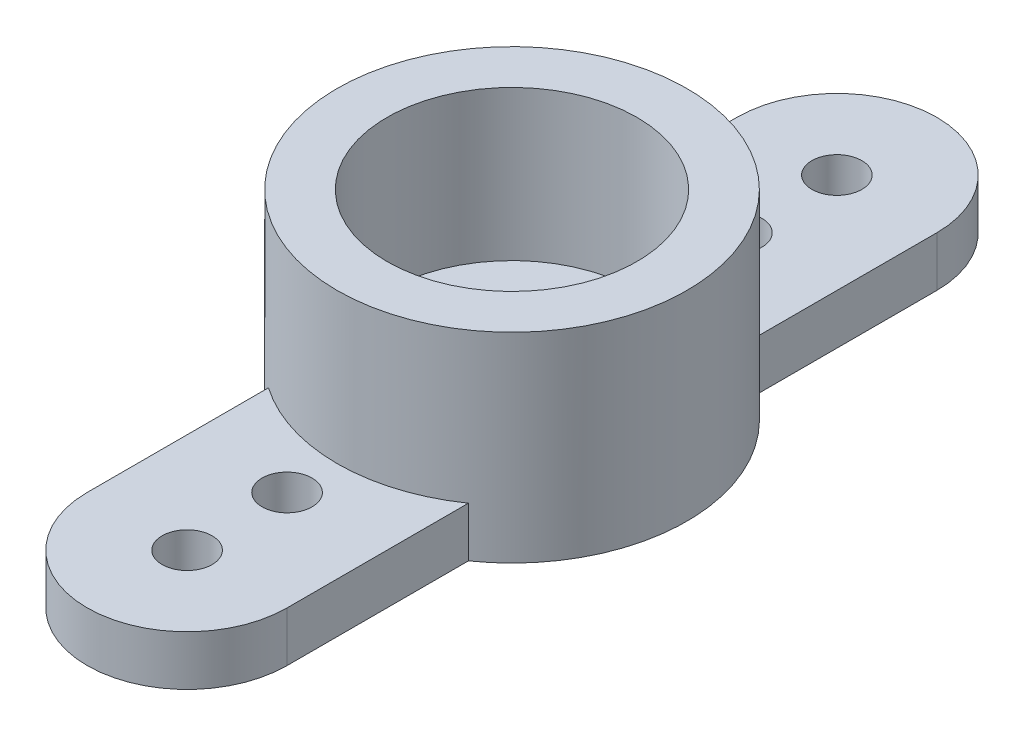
from build123d import *

# Parameters (mm, degrees)
SKETCH1_R           = 3.5
SKETCH1_R_2         = 2.5
BOSS_EXTRUDE1_DEPTH = 4
SKETCH2_R           = 2.5
BOSS_EXTRUDE2_DEPTH = 1
SKETCH3_R           = 0.5
CUT_EXTRUDE1_DEPTH  = 10.669539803


with BuildPart() as part:
    # Sketch1 → Boss-Extrude1 (new body)
    with BuildSketch(Plane(origin=(0, 0, 0), x_dir=(1, 0, 0), z_dir=(0, 1, 0))):
        with Locations(Location((0, 0, 0), (0, 0, 270))):
            Circle(SKETCH1_R)
        with Locations(Location((0, 0, 0), (0, 0, 270))):
            Circle(SKETCH1_R_2, mode=Mode.SUBTRACT)
    extrude(amount=BOSS_EXTRUDE1_DEPTH)

    # Sketch2 → Boss-Extrude2 (add)
    with BuildSketch(Plane(origin=(0, 0, 0), x_dir=(1, 0, 0), z_dir=(0, 1, 0))):
        with Locations(Location((0, 0, 0), (0, 0, 270))):
            Circle(SKETCH2_R)
        with BuildLine():
            Line((-2, 2.872281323), (-2, 6.5))
            ThreePointArc((-2, 6.5), (0, 8.5), (2, 6.5))
            Line((2, 6.5), (2, 2.872281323))
            ThreePointArc((2, 2.872281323), (0, 3.5), (-2, 2.872281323))
        make_face()
        with BuildLine():
            Line((2, -6.5), (2, -2.872281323))
            ThreePointArc((2, -2.872281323), (0, -3.5), (-2, -2.872281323))
            Line((-2, -2.872281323), (-2, -6.5))
            ThreePointArc((-2, -6.5), (0, -8.5), (2, -6.5))
        make_face()
    extrude(amount=BOSS_EXTRUDE2_DEPTH)

    # Sketch3 → Cut-Extrude1 (cut, through all)
    with BuildSketch(Plane(origin=(0, 1, 0), x_dir=(1, 0, 0), z_dir=(0, 1, 0))):
        with Locations(Location((0, 6.5, 0), (0, 0, 270))):
            Circle(SKETCH3_R)
        with Locations(Location((0, 4.5, 0), (0, 0, 270))):
            Circle(SKETCH3_R)
        with Locations(Location((0, -4.5, 0), (0, 0, 90))):
            Circle(SKETCH3_R)
        with Locations(Location((0, -6.5, 0), (0, 0, 90))):
            Circle(SKETCH3_R)
    extrude(amount=-CUT_EXTRUDE1_DEPTH, mode=Mode.SUBTRACT)


solid = part.part
